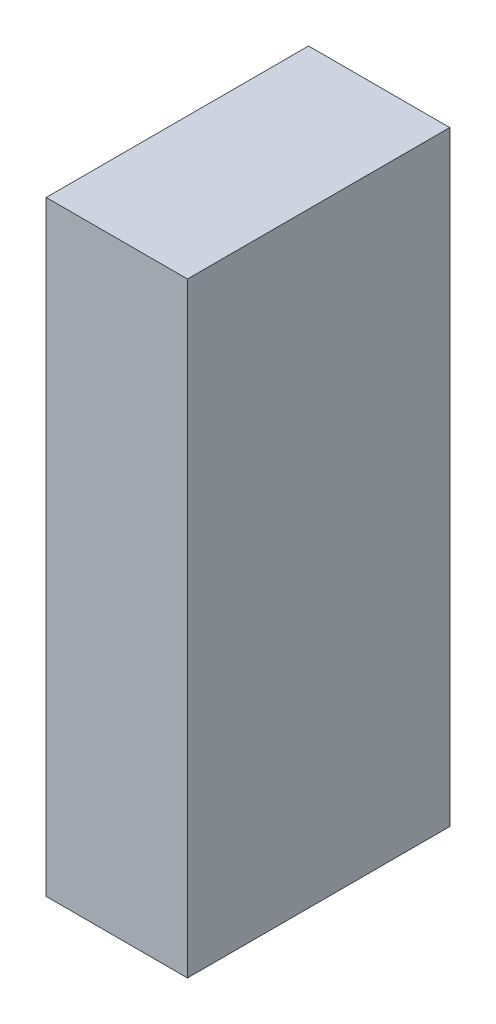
from build123d import *

# Parameters (mm, degrees)
ESQUISSE1_W      = 35
ESQUISSE1_H      = 150
EXTRUSION1_DEPTH = 65


with BuildPart() as part:
    # Esquisse1 → Extrusion1 (new body)
    with BuildSketch(Plane.XY):
        with Locations((17.5, 75)):
            Rectangle(ESQUISSE1_W, ESQUISSE1_H)
    extrude(amount=EXTRUSION1_DEPTH)


solid = part.part
